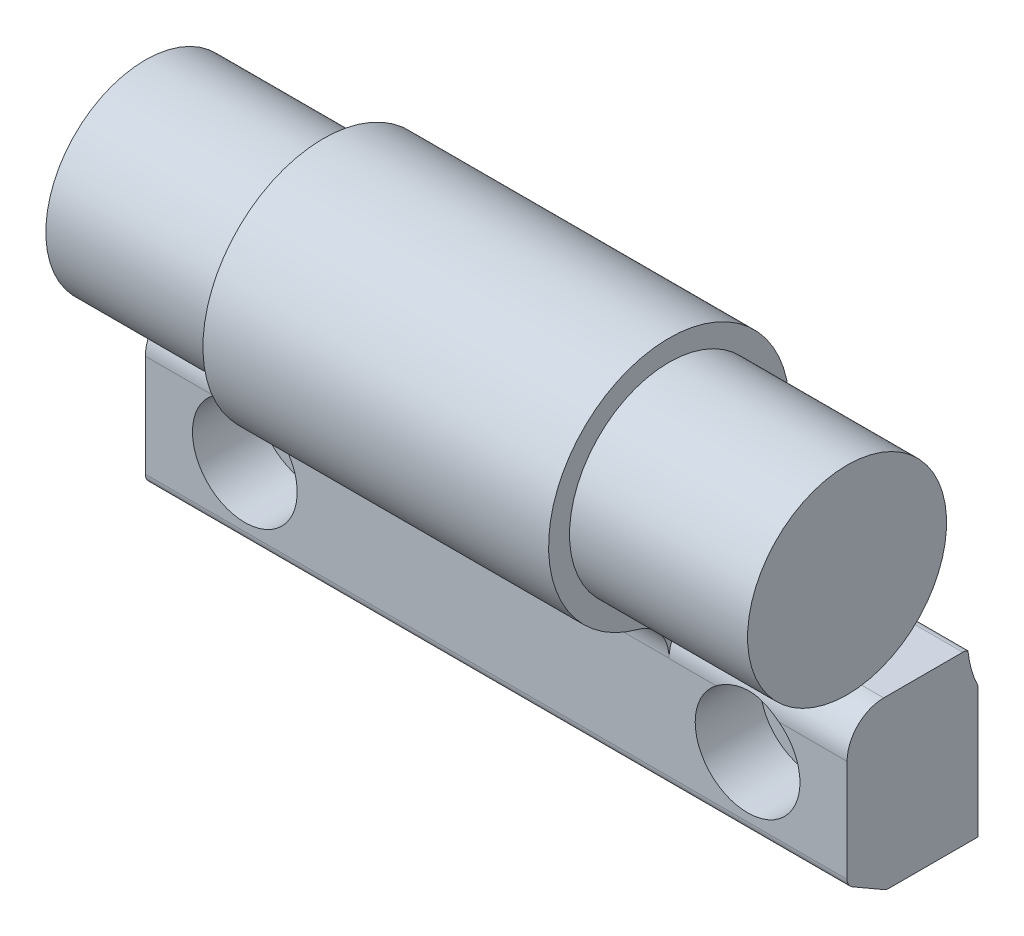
ISO-10303-21;
HEADER;
FILE_DESCRIPTION(('STEP AP214'),'2;1');
FILE_NAME('part.step','',(''),(''),'','','');
FILE_SCHEMA(('AUTOMOTIVE_DESIGN { 1 0 10303 214 1 1 1 1 }'));
ENDSEC;
DATA;
#1=APPLICATION_CONTEXT('core data for automotive mechanical design processes');
#2=APPLICATION_PROTOCOL_DEFINITION('international standard','automotive_design',2000,#1);
#3=PRODUCT_CONTEXT('',#1,'mechanical');
#4=PRODUCT('Part','Part','',(#3));
#5=PRODUCT_RELATED_PRODUCT_CATEGORY('part','',(#4));
#6=PRODUCT_DEFINITION_FORMATION('','',#4);
#7=PRODUCT_DEFINITION_CONTEXT('part definition',#1,'design');
#8=PRODUCT_DEFINITION('design','',#6,#7);
#9=PRODUCT_DEFINITION_SHAPE('','',#8);
#10=(LENGTH_UNIT() NAMED_UNIT(*) SI_UNIT(.MILLI.,.METRE.));
#11=(NAMED_UNIT(*) PLANE_ANGLE_UNIT() SI_UNIT($,.RADIAN.));
#12=(NAMED_UNIT(*) SI_UNIT($,.STERADIAN.) SOLID_ANGLE_UNIT());
#13=UNCERTAINTY_MEASURE_WITH_UNIT(LENGTH_MEASURE(1.E-05),#10,'distance_accuracy_value','');
#14=(GEOMETRIC_REPRESENTATION_CONTEXT(3) GLOBAL_UNCERTAINTY_ASSIGNED_CONTEXT((#13)) GLOBAL_UNIT_ASSIGNED_CONTEXT((#10,
#11,#12)) REPRESENTATION_CONTEXT('',''));
#15=CARTESIAN_POINT('',(0.,0.,0.));
#16=DIRECTION('',(0.,0.,1.));
#17=DIRECTION('',(1.,0.,0.));
#18=AXIS2_PLACEMENT_3D('',#15,#16,#17);
#19=CARTESIAN_POINT('',(-26.,4.,9.));
#20=DIRECTION('',(1.,0.,0.));
#21=DIRECTION('',(0.,1.,0.));
#22=AXIS2_PLACEMENT_3D('',#19,#20,#21);
#23=CYLINDRICAL_SURFACE('',#22,3.5);
#24=DIRECTION('',(1.,0.,0.));
#25=VECTOR('',#24,1.);
#26=CARTESIAN_POINT('',(-26.,4.,12.5));
#27=LINE('',#26,#25);
#28=CARTESIAN_POINT('',(-9.5,4.,12.5));
#29=VERTEX_POINT('',#28);
#30=CARTESIAN_POINT('',(-3.,4.,12.5));
#31=VERTEX_POINT('',#30);
#32=EDGE_CURVE('E160',#29,#31,#27,.T.);
#33=ORIENTED_EDGE('',*,*,#32,.T.);
#34=CARTESIAN_POINT('',(-3.,4.,12.5));
#35=CARTESIAN_POINT('',(-2.88058704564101,4.08958421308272,12.4999653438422));
#36=CARTESIAN_POINT('',(-2.75720915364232,4.17373790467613,12.4965609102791));
#37=CARTESIAN_POINT('',(-2.50364298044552,4.33058069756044,12.4852485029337));
#38=CARTESIAN_POINT('',(-2.37345839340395,4.40327593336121,12.4773429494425));
#39=CARTESIAN_POINT('',(-2.10719122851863,4.53673407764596,12.4592542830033));
#40=CARTESIAN_POINT('',(-1.9711053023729,4.59749010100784,12.4490698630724));
#41=CARTESIAN_POINT('',(-1.69406820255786,4.70662206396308,12.4283781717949));
#42=CARTESIAN_POINT('',(-1.55311680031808,4.75499742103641,12.4178708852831));
#43=CARTESIAN_POINT('',(-1.27819658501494,4.8358206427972,12.3989692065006));
#44=CARTESIAN_POINT('',(-1.14450692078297,4.869197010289,12.3904750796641));
#45=CARTESIAN_POINT('',(-0.874713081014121,4.92481904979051,12.3757281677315));
#46=CARTESIAN_POINT('',(-0.738609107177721,4.9470656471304,12.3694751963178));
#47=CARTESIAN_POINT('',(-0.465141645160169,4.9802191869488,12.3599804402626));
#48=CARTESIAN_POINT('',(-0.327780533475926,4.9911443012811,12.3567338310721));
#49=CARTESIAN_POINT('',(-0.0525849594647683,5.00161918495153,12.3536233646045));
#50=CARTESIAN_POINT('',(0.0852495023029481,5.00116896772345,12.3537595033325));
#51=CARTESIAN_POINT('',(0.359420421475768,4.98893961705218,12.3573855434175));
#52=CARTESIAN_POINT('',(0.495760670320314,4.97723817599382,12.3608524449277));
#53=CARTESIAN_POINT('',(0.766921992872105,4.94272313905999,12.3706963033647));
#54=CARTESIAN_POINT('',(0.901743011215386,4.91990913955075,12.3770733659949));
#55=CARTESIAN_POINT('',(1.16909466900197,4.86332301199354,12.3919799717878));
#56=CARTESIAN_POINT('',(1.30162258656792,4.82953869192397,12.4005119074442));
#57=CARTESIAN_POINT('',(1.56339331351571,4.75125897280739,12.4186580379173));
#58=CARTESIAN_POINT('',(1.69263634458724,4.70676429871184,12.4282721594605));
#59=CARTESIAN_POINT('',(1.92498462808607,4.61597017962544,12.4456242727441));
#60=CARTESIAN_POINT('',(2.02873605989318,4.57132161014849,12.4533985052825));
#61=CARTESIAN_POINT('',(2.2330169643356,4.47508437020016,12.4679477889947));
#62=CARTESIAN_POINT('',(2.33354721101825,4.42349738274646,12.4747230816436));
#63=CARTESIAN_POINT('',(2.53079260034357,4.3136759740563,12.4863526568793));
#64=CARTESIAN_POINT('',(2.62751436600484,4.25545384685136,12.4912104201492));
#65=CARTESIAN_POINT('',(2.8169194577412,4.1325220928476,12.4980294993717));
#66=CARTESIAN_POINT('',(2.90960055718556,4.06780895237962,12.4999892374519));
#67=CARTESIAN_POINT('',(3.,4.,12.5));
#68=B_SPLINE_CURVE_WITH_KNOTS('',3,(#34,#35,#36,#37,#38,#39,#40,#41,#42,#43,#44,#45,#46,#47,#48,
#49,#50,#51,#52,#53,#54,#55,#56,#57,#58,#59,#60,#61,#62,#63,#64,#65,#66,#67),.UNSPECIFIED.,.F.,
.F.,(4,2,2,2,2,2,2,2,2,2,2,2,2,2,2,2,4),(0.,0.447535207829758,0.894829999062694,
1.34238198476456,1.78995502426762,2.20364646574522,2.61730350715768,3.0302955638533,
3.44328713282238,3.85344722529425,4.26362221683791,4.67425463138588,5.08485925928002,
5.42426309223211,5.76358474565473,6.1022876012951,6.44117480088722),.UNSPECIFIED.);
#69=CARTESIAN_POINT('',(3.,4.,12.5));
#70=VERTEX_POINT('',#69);
#71=EDGE_CURVE('E9',#31,#70,#68,.T.);
#72=ORIENTED_EDGE('',*,*,#71,.T.);
#73=CARTESIAN_POINT('',(7.5,4.,12.5));
#74=VERTEX_POINT('',#73);
#75=EDGE_CURVE('E163',#70,#74,#27,.T.);
#76=ORIENTED_EDGE('',*,*,#75,.T.);
#77=CARTESIAN_POINT('',(7.5,4.,9.));
#78=DIRECTION('',(1.,0.,0.));
#79=DIRECTION('',(0.,1.,0.));
#80=AXIS2_PLACEMENT_3D('',#77,#78,#79);
#81=CIRCLE('',#80,3.5);
#82=CARTESIAN_POINT('',(7.5,7.5,9.00000005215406));
#83=VERTEX_POINT('',#82);
#84=EDGE_CURVE('E408',#83,#74,#81,.T.);
#85=ORIENTED_EDGE('',*,*,#84,.F.);
#86=DIRECTION('',(1.,0.,0.));
#87=VECTOR('',#86,1.);
#88=CARTESIAN_POINT('',(-26.,7.5,9.00000005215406));
#89=LINE('',#88,#87);
#90=CARTESIAN_POINT('',(-9.5,7.5,9.00000005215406));
#91=VERTEX_POINT('',#90);
#92=EDGE_CURVE('E175',#91,#83,#89,.T.);
#93=ORIENTED_EDGE('',*,*,#92,.F.);
#94=CARTESIAN_POINT('',(-9.5,4.,9.));
#95=DIRECTION('',(1.,0.,0.));
#96=DIRECTION('',(0.,1.,0.));
#97=AXIS2_PLACEMENT_3D('',#94,#95,#96);
#98=CIRCLE('',#97,3.5);
#99=EDGE_CURVE('E169',#91,#29,#98,.T.);
#100=ORIENTED_EDGE('',*,*,#99,.T.);
#101=EDGE_LOOP('',(#33,#72,#76,#85,#93,#100));
#102=FACE_BOUND('',#101,.T.);
#103=ADVANCED_FACE('F14',(#102),#23,.T.);
#104=CARTESIAN_POINT('',(74.,4.,9.));
#105=DIRECTION('',(-1.,0.,0.));
#106=DIRECTION('',(0.,-1.,0.));
#107=AXIS2_PLACEMENT_3D('',#104,#105,#106);
#108=CYLINDRICAL_SURFACE('',#107,3.5);
#109=CARTESIAN_POINT('',(51.,4.,12.5));
#110=CARTESIAN_POINT('',(50.880587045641,4.08958421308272,12.4999653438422));
#111=CARTESIAN_POINT('',(50.7572091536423,4.17373790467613,12.4965609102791));
#112=CARTESIAN_POINT('',(50.5036429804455,4.33058069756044,12.4852485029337));
#113=CARTESIAN_POINT('',(50.373458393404,4.40327593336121,12.4773429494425));
#114=CARTESIAN_POINT('',(50.1071912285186,4.53673407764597,12.4592542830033));
#115=CARTESIAN_POINT('',(49.9711053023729,4.59749010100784,12.4490698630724));
#116=CARTESIAN_POINT('',(49.6940682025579,4.70662206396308,12.4283781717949));
#117=CARTESIAN_POINT('',(49.5531168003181,4.75499742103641,12.4178708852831));
#118=CARTESIAN_POINT('',(49.2781965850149,4.8358206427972,12.3989692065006));
#119=CARTESIAN_POINT('',(49.144506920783,4.869197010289,12.3904750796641));
#120=CARTESIAN_POINT('',(48.8747130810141,4.92481904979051,12.3757281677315));
#121=CARTESIAN_POINT('',(48.7386091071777,4.9470656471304,12.3694751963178));
#122=CARTESIAN_POINT('',(48.4651416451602,4.9802191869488,12.3599804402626));
#123=CARTESIAN_POINT('',(48.327780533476,4.9911443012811,12.3567338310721));
#124=CARTESIAN_POINT('',(48.0525849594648,5.00161918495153,12.3536233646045));
#125=CARTESIAN_POINT('',(47.9147504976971,5.00116896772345,12.3537595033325));
#126=CARTESIAN_POINT('',(47.6405795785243,4.98893961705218,12.3573855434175));
#127=CARTESIAN_POINT('',(47.5042393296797,4.97723817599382,12.3608524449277));
#128=CARTESIAN_POINT('',(47.2330780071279,4.94272313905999,12.3706963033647));
#129=CARTESIAN_POINT('',(47.0982569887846,4.91990913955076,12.3770733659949));
#130=CARTESIAN_POINT('',(46.830905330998,4.86332301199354,12.3919799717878));
#131=CARTESIAN_POINT('',(46.6983774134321,4.82953869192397,12.4005119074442));
#132=CARTESIAN_POINT('',(46.4366066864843,4.75125897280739,12.4186580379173));
#133=CARTESIAN_POINT('',(46.3073636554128,4.70676429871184,12.4282721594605));
#134=CARTESIAN_POINT('',(46.0750153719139,4.61597017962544,12.4456242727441));
#135=CARTESIAN_POINT('',(45.9712639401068,4.57132161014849,12.4533985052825));
#136=CARTESIAN_POINT('',(45.7669830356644,4.47508437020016,12.4679477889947));
#137=CARTESIAN_POINT('',(45.6664527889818,4.42349738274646,12.4747230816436));
#138=CARTESIAN_POINT('',(45.4692073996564,4.3136759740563,12.4863526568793));
#139=CARTESIAN_POINT('',(45.3724856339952,4.25545384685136,12.4912104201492));
#140=CARTESIAN_POINT('',(45.1830805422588,4.1325220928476,12.4980294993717));
#141=CARTESIAN_POINT('',(45.0903994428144,4.06780895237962,12.4999892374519));
#142=CARTESIAN_POINT('',(45.,4.,12.5));
#143=B_SPLINE_CURVE_WITH_KNOTS('',3,(#109,#110,#111,#112,#113,#114,#115,#116,#117,#118,#119,
#120,#121,#122,#123,#124,#125,#126,#127,#128,#129,#130,#131,#132,#133,#134,#135,#136,#137,#138,
#139,#140,#141,#142),.UNSPECIFIED.,.F.,.F.,(4,2,2,2,2,2,2,2,2,2,2,2,2,2,2,2,4),(0.,
0.447535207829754,0.894829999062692,1.34238198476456,1.78995502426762,2.20364646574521,
2.61730350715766,3.03029556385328,3.44328713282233,3.85344722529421,4.26362221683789,
4.67425463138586,5.08485925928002,5.42426309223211,5.76358474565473,6.10228760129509,
6.44117480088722),.UNSPECIFIED.);
#144=CARTESIAN_POINT('',(51.,4.,12.5));
#145=VERTEX_POINT('',#144);
#146=CARTESIAN_POINT('',(45.,4.,12.5));
#147=VERTEX_POINT('',#146);
#148=EDGE_CURVE('E28',#145,#147,#143,.T.);
#149=ORIENTED_EDGE('',*,*,#148,.F.);
#150=DIRECTION('',(-1.,0.,0.));
#151=VECTOR('',#150,1.);
#152=CARTESIAN_POINT('',(74.,4.,12.5));
#153=LINE('',#152,#151);
#154=CARTESIAN_POINT('',(57.5,4.,12.5));
#155=VERTEX_POINT('',#154);
#156=EDGE_CURVE('E428',#155,#145,#153,.T.);
#157=ORIENTED_EDGE('',*,*,#156,.F.);
#158=CARTESIAN_POINT('',(57.5,4.,9.));
#159=DIRECTION('',(1.,0.,0.));
#160=DIRECTION('',(0.,1.,0.));
#161=AXIS2_PLACEMENT_3D('',#158,#159,#160);
#162=CIRCLE('',#161,3.5);
#163=CARTESIAN_POINT('',(57.5,7.5,9.00000005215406));
#164=VERTEX_POINT('',#163);
#165=EDGE_CURVE('E260',#155,#164,#162,.F.);
#166=ORIENTED_EDGE('',*,*,#165,.T.);
#167=DIRECTION('',(-1.,0.,0.));
#168=VECTOR('',#167,1.);
#169=CARTESIAN_POINT('',(74.,7.5,9.00000005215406));
#170=LINE('',#169,#168);
#171=CARTESIAN_POINT('',(40.5,7.5,9.00000005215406));
#172=VERTEX_POINT('',#171);
#173=EDGE_CURVE('E431',#164,#172,#170,.T.);
#174=ORIENTED_EDGE('',*,*,#173,.T.);
#175=CARTESIAN_POINT('',(40.5,4.,9.));
#176=DIRECTION('',(1.,0.,0.));
#177=DIRECTION('',(0.,1.,0.));
#178=AXIS2_PLACEMENT_3D('',#175,#176,#177);
#179=CIRCLE('',#178,3.5);
#180=CARTESIAN_POINT('',(40.5,4.,12.5));
#181=VERTEX_POINT('',#180);
#182=EDGE_CURVE('E268',#172,#181,#179,.T.);
#183=ORIENTED_EDGE('',*,*,#182,.T.);
#184=EDGE_CURVE('E430',#147,#181,#153,.T.);
#185=ORIENTED_EDGE('',*,*,#184,.F.);
#186=EDGE_LOOP('',(#149,#157,#166,#174,#183,#185));
#187=FACE_BOUND('',#186,.T.);
#188=ADVANCED_FACE('F276',(#187),#108,.T.);
#189=CARTESIAN_POINT('',(57.5,4.02502086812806,12.5));
#190=DIRECTION('',(0.,0.,-1.));
#191=DIRECTION('',(-1.,0.,0.));
#192=AXIS2_PLACEMENT_3D('',#189,#190,#191);
#193=PLANE('',#192);
#194=ORIENTED_EDGE('',*,*,#75,.F.);
#195=CARTESIAN_POINT('',(0.,0.,12.5));
#196=DIRECTION('',(0.,0.,-1.));
#197=DIRECTION('',(-1.,0.,0.));
#198=AXIS2_PLACEMENT_3D('',#195,#196,#197);
#199=CIRCLE('',#198,5.);
#200=EDGE_CURVE('E34',#70,#31,#199,.T.);
#201=ORIENTED_EDGE('',*,*,#200,.T.);
#202=ORIENTED_EDGE('',*,*,#32,.F.);
#203=DIRECTION('',(0.,-1.,0.));
#204=VECTOR('',#203,1.);
#205=CARTESIAN_POINT('',(-9.5,4.02502086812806,12.5));
#206=LINE('',#205,#204);
#207=CARTESIAN_POINT('',(-9.5,-5.7575862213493,12.5));
#208=VERTEX_POINT('',#207);
#209=EDGE_CURVE('E218',#29,#208,#206,.T.);
#210=ORIENTED_EDGE('',*,*,#209,.T.);
#211=DIRECTION('',(-1.,0.,0.));
#212=VECTOR('',#211,1.);
#213=CARTESIAN_POINT('',(57.5,-5.7575862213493,12.5));
#214=LINE('',#213,#212);
#215=CARTESIAN_POINT('',(57.5,-5.7575862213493,12.5));
#216=VERTEX_POINT('',#215);
#217=EDGE_CURVE('E228',#216,#208,#214,.T.);
#218=ORIENTED_EDGE('',*,*,#217,.F.);
#219=DIRECTION('',(0.,-1.,0.));
#220=VECTOR('',#219,1.);
#221=CARTESIAN_POINT('',(57.5,4.02502086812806,12.5));
#222=LINE('',#221,#220);
#223=EDGE_CURVE('E201',#155,#216,#222,.T.);
#224=ORIENTED_EDGE('',*,*,#223,.F.);
#225=ORIENTED_EDGE('',*,*,#156,.T.);
#226=CARTESIAN_POINT('',(48.,0.,12.5));
#227=DIRECTION('',(0.,0.,-1.));
#228=DIRECTION('',(-1.,0.,0.));
#229=AXIS2_PLACEMENT_3D('',#226,#227,#228);
#230=CIRCLE('',#229,5.);
#231=EDGE_CURVE('E40',#145,#147,#230,.T.);
#232=ORIENTED_EDGE('',*,*,#231,.T.);
#233=ORIENTED_EDGE('',*,*,#184,.T.);
#234=DIRECTION('',(0.,-1.,0.));
#235=VECTOR('',#234,1.);
#236=CARTESIAN_POINT('',(40.5,4.02502086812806,12.5));
#237=LINE('',#236,#235);
#238=CARTESIAN_POINT('',(40.5,4.02502086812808,12.5));
#239=VERTEX_POINT('',#238);
#240=EDGE_CURVE('E420',#239,#181,#237,.T.);
#241=ORIENTED_EDGE('',*,*,#240,.F.);
#242=DIRECTION('',(-1.,0.,0.));
#243=VECTOR('',#242,1.);
#244=CARTESIAN_POINT('',(57.5,4.02502086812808,12.5));
#245=LINE('',#244,#243);
#246=CARTESIAN_POINT('',(7.5,4.02502086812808,12.5));
#247=VERTEX_POINT('',#246);
#248=EDGE_CURVE('E231',#239,#247,#245,.T.);
#249=ORIENTED_EDGE('',*,*,#248,.T.);
#250=DIRECTION('',(0.,-1.,0.));
#251=VECTOR('',#250,1.);
#252=CARTESIAN_POINT('',(7.5,4.02502086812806,12.5));
#253=LINE('',#252,#251);
#254=EDGE_CURVE('E253',#247,#74,#253,.T.);
#255=ORIENTED_EDGE('',*,*,#254,.T.);
#256=EDGE_LOOP('',(#194,#201,#202,#210,#218,#224,#225,#232,#233,#241,#249,#255));
#257=FACE_BOUND('',#256,.T.);
#258=ADVANCED_FACE('F159',(#257),#193,.F.);
#259=CARTESIAN_POINT('',(57.5,8.,1.));
#260=DIRECTION('',(0.,0.,1.));
#261=DIRECTION('',(1.,0.,0.));
#262=AXIS2_PLACEMENT_3D('',#259,#260,#261);
#263=PLANE('',#262);
#264=DIRECTION('',(0.,1.,0.));
#265=VECTOR('',#264,1.);
#266=CARTESIAN_POINT('',(40.5,8.,1.));
#267=LINE('',#266,#265);
#268=CARTESIAN_POINT('',(40.5,8.,1.));
#269=VERTEX_POINT('',#268);
#270=CARTESIAN_POINT('',(40.5,19.,1.));
#271=VERTEX_POINT('',#270);
#272=EDGE_CURVE('E423',#269,#271,#267,.T.);
#273=ORIENTED_EDGE('',*,*,#272,.F.);
#274=DIRECTION('',(-1.,0.,0.));
#275=VECTOR('',#274,1.);
#276=CARTESIAN_POINT('',(57.5,8.,1.));
#277=LINE('',#276,#275);
#278=CARTESIAN_POINT('',(7.5,8.,1.));
#279=VERTEX_POINT('',#278);
#280=EDGE_CURVE('E237',#269,#279,#277,.T.);
#281=ORIENTED_EDGE('',*,*,#280,.T.);
#282=DIRECTION('',(0.,1.,0.));
#283=VECTOR('',#282,1.);
#284=CARTESIAN_POINT('',(7.5,8.,1.));
#285=LINE('',#284,#283);
#286=CARTESIAN_POINT('',(7.5,19.,1.));
#287=VERTEX_POINT('',#286);
#288=EDGE_CURVE('E184',#279,#287,#285,.T.);
#289=ORIENTED_EDGE('',*,*,#288,.T.);
#290=DIRECTION('',(-1.,0.,0.));
#291=VECTOR('',#290,1.);
#292=CARTESIAN_POINT('',(57.5,19.,1.));
#293=LINE('',#292,#291);
#294=EDGE_CURVE('E235',#271,#287,#293,.T.);
#295=ORIENTED_EDGE('',*,*,#294,.F.);
#296=EDGE_LOOP('',(#273,#281,#289,#295));
#297=FACE_BOUND('',#296,.T.);
#298=ADVANCED_FACE('F351',(#297),#263,.F.);
#299=CARTESIAN_POINT('',(57.5,19.,12.5));
#300=DIRECTION('',(-1.,0.,0.));
#301=DIRECTION('',(0.,-1.,0.));
#302=AXIS2_PLACEMENT_3D('',#299,#300,#301);
#303=CYLINDRICAL_SURFACE('',#302,11.5);
#304=CARTESIAN_POINT('',(40.5,19.,12.5));
#305=DIRECTION('',(1.,0.,0.));
#306=DIRECTION('',(0.,1.,0.));
#307=AXIS2_PLACEMENT_3D('',#304,#305,#306);
#308=CIRCLE('',#307,11.5);
#309=CARTESIAN_POINT('',(40.5,7.88953161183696,15.4677419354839));
#310=VERTEX_POINT('',#309);
#311=EDGE_CURVE('E425',#271,#310,#308,.T.);
#312=ORIENTED_EDGE('',*,*,#311,.F.);
#313=ORIENTED_EDGE('',*,*,#294,.T.);
#314=CARTESIAN_POINT('',(7.5,19.,12.5));
#315=DIRECTION('',(1.,0.,0.));
#316=DIRECTION('',(0.,1.,0.));
#317=AXIS2_PLACEMENT_3D('',#314,#315,#316);
#318=CIRCLE('',#317,11.5);
#319=CARTESIAN_POINT('',(7.5,7.88953161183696,15.4677419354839));
#320=VERTEX_POINT('',#319);
#321=EDGE_CURVE('E181',#287,#320,#318,.T.);
#322=ORIENTED_EDGE('',*,*,#321,.T.);
#323=DIRECTION('',(-1.,0.,0.));
#324=VECTOR('',#323,1.);
#325=CARTESIAN_POINT('',(57.5,7.88953161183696,15.4677419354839));
#326=LINE('',#325,#324);
#327=EDGE_CURVE('E233',#310,#320,#326,.T.);
#328=ORIENTED_EDGE('',*,*,#327,.F.);
#329=EDGE_LOOP('',(#312,#313,#322,#328));
#330=FACE_BOUND('',#329,.T.);
#331=ADVANCED_FACE('F354',(#330),#303,.T.);
#332=CARTESIAN_POINT('',(57.5,4.02502086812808,16.5));
#333=DIRECTION('',(-1.,0.,0.));
#334=DIRECTION('',(0.,-1.,0.));
#335=AXIS2_PLACEMENT_3D('',#332,#333,#334);
#336=CYLINDRICAL_SURFACE('',#335,4.);
#337=ORIENTED_EDGE('',*,*,#248,.F.);
#338=CARTESIAN_POINT('',(40.5,4.02502086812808,16.5));
#339=DIRECTION('',(1.,0.,0.));
#340=DIRECTION('',(0.,1.,0.));
#341=AXIS2_PLACEMENT_3D('',#338,#339,#340);
#342=CIRCLE('',#341,4.);
#343=EDGE_CURVE('E262',#239,#310,#342,.T.);
#344=ORIENTED_EDGE('',*,*,#343,.T.);
#345=ORIENTED_EDGE('',*,*,#327,.T.);
#346=CARTESIAN_POINT('',(7.5,4.02502086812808,16.5));
#347=DIRECTION('',(1.,0.,0.));
#348=DIRECTION('',(0.,1.,0.));
#349=AXIS2_PLACEMENT_3D('',#346,#347,#348);
#350=CIRCLE('',#349,4.);
#351=EDGE_CURVE('E173',#247,#320,#350,.T.);
#352=ORIENTED_EDGE('',*,*,#351,.F.);
#353=EDGE_LOOP('',(#337,#344,#345,#352));
#354=FACE_BOUND('',#353,.T.);
#355=ADVANCED_FACE('F334',(#354),#336,.F.);
#356=CARTESIAN_POINT('',(57.5,-7.5,8.48205080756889));
#357=DIRECTION('',(1.,0.,0.));
#358=DIRECTION('',(0.,1.,0.));
#359=AXIS2_PLACEMENT_3D('',#356,#357,#358);
#360=PLANE('',#359);
#361=ORIENTED_EDGE('',*,*,#165,.F.);
#362=ORIENTED_EDGE('',*,*,#223,.T.);
#363=CARTESIAN_POINT('',(57.5,-5.7575862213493,11.5));
#364=DIRECTION('',(1.,0.,0.));
#365=DIRECTION('',(0.,1.,0.));
#366=AXIS2_PLACEMENT_3D('',#363,#364,#365);
#367=CIRCLE('',#366,1.);
#368=CARTESIAN_POINT('',(57.5,-6.6236116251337,12.));
#369=VERTEX_POINT('',#368);
#370=EDGE_CURVE('E203',#216,#369,#367,.T.);
#371=ORIENTED_EDGE('',*,*,#370,.T.);
#372=DIRECTION('',(0.,-0.5,-0.866025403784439));
#373=VECTOR('',#372,1.);
#374=CARTESIAN_POINT('',(57.5,-6.6236116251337,12.));
#375=LINE('',#374,#373);
#376=CARTESIAN_POINT('',(57.5,-8.36602540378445,8.98205080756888));
#377=VERTEX_POINT('',#376);
#378=EDGE_CURVE('E205',#369,#377,#375,.T.);
#379=ORIENTED_EDGE('',*,*,#378,.T.);
#380=CARTESIAN_POINT('',(57.5,-7.5,8.48205080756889));
#381=DIRECTION('',(1.,0.,0.));
#382=DIRECTION('',(0.,1.,0.));
#383=AXIS2_PLACEMENT_3D('',#380,#381,#382);
#384=CIRCLE('',#383,0.999999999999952);
#385=CARTESIAN_POINT('',(57.5,-8.5,8.48205080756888));
#386=VERTEX_POINT('',#385);
#387=EDGE_CURVE('E190',#377,#386,#384,.T.);
#388=ORIENTED_EDGE('',*,*,#387,.T.);
#389=DIRECTION('',(0.,0.,-1.));
#390=VECTOR('',#389,1.);
#391=CARTESIAN_POINT('',(57.5,-8.5,8.48205080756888));
#392=LINE('',#391,#390);
#393=CARTESIAN_POINT('',(57.5,-8.5,0.));
#394=VERTEX_POINT('',#393);
#395=EDGE_CURVE('E193',#386,#394,#392,.T.);
#396=ORIENTED_EDGE('',*,*,#395,.T.);
#397=DIRECTION('',(0.,1.,0.));
#398=VECTOR('',#397,1.);
#399=CARTESIAN_POINT('',(57.5,-8.5,0.));
#400=LINE('',#399,#398);
#401=CARTESIAN_POINT('',(57.5,4.,0.));
#402=VERTEX_POINT('',#401);
#403=EDGE_CURVE('E196',#394,#402,#400,.T.);
#404=ORIENTED_EDGE('',*,*,#403,.T.);
#405=CARTESIAN_POINT('',(57.5,8.37325787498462,-8.99303149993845));
#406=DIRECTION('',(1.,0.,0.));
#407=DIRECTION('',(0.,1.,0.));
#408=AXIS2_PLACEMENT_3D('',#405,#406,#407);
#409=CIRCLE('',#408,10.);
#410=CARTESIAN_POINT('',(57.5,7.36760936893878,0.956273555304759));
#411=VERTEX_POINT('',#410);
#412=EDGE_CURVE('E199',#411,#402,#409,.T.);
#413=ORIENTED_EDGE('',*,*,#412,.F.);
#414=CARTESIAN_POINT('',(57.5,6.5,1.4535199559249));
#415=DIRECTION('',(1.,0.,0.));
#416=DIRECTION('',(0.,1.,0.));
#417=AXIS2_PLACEMENT_3D('',#414,#415,#416);
#418=CIRCLE('',#417,1.);
#419=CARTESIAN_POINT('',(57.5,7.5,1.4535199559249));
#420=VERTEX_POINT('',#419);
#421=EDGE_CURVE('E255',#420,#411,#418,.F.);
#422=ORIENTED_EDGE('',*,*,#421,.F.);
#423=DIRECTION('',(0.,0.,1.));
#424=VECTOR('',#423,1.);
#425=CARTESIAN_POINT('',(57.5,7.5,8.48205080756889));
#426=LINE('',#425,#424);
#427=EDGE_CURVE('E257',#420,#164,#426,.T.);
#428=ORIENTED_EDGE('',*,*,#427,.T.);
#429=EDGE_LOOP('',(#361,#362,#371,#379,#388,#396,#404,#413,#422,#428));
#430=FACE_BOUND('',#429,.T.);
#431=ADVANCED_FACE('F330',(#430),#360,.T.);
#432=CARTESIAN_POINT('',(57.5,8.37325787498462,-8.99303149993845));
#433=DIRECTION('',(-1.,0.,0.));
#434=DIRECTION('',(0.,-1.,0.));
#435=AXIS2_PLACEMENT_3D('',#432,#433,#434);
#436=CYLINDRICAL_SURFACE('',#435,10.);
#437=DIRECTION('',(-1.,0.,0.));
#438=VECTOR('',#437,1.);
#439=CARTESIAN_POINT('',(57.25,7.36760936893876,0.956273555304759));
#440=LINE('',#439,#438);
#441=CARTESIAN_POINT('',(40.5,7.36760936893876,0.956273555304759));
#442=VERTEX_POINT('',#441);
#443=EDGE_CURVE('E388',#411,#442,#440,.T.);
#444=ORIENTED_EDGE('',*,*,#443,.F.);
#445=ORIENTED_EDGE('',*,*,#412,.T.);
#446=DIRECTION('',(-1.,0.,0.));
#447=VECTOR('',#446,1.);
#448=CARTESIAN_POINT('',(57.5,4.,0.));
#449=LINE('',#448,#447);
#450=CARTESIAN_POINT('',(-9.5,4.,0.));
#451=VERTEX_POINT('',#450);
#452=EDGE_CURVE('E239',#402,#451,#449,.T.);
#453=ORIENTED_EDGE('',*,*,#452,.T.);
#454=CARTESIAN_POINT('',(-9.5,8.37325787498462,-8.99303149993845));
#455=DIRECTION('',(1.,0.,0.));
#456=DIRECTION('',(0.,1.,0.));
#457=AXIS2_PLACEMENT_3D('',#454,#455,#456);
#458=CIRCLE('',#457,10.);
#459=CARTESIAN_POINT('',(-9.5,7.36760936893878,0.956273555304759));
#460=VERTEX_POINT('',#459);
#461=EDGE_CURVE('E215',#460,#451,#458,.T.);
#462=ORIENTED_EDGE('',*,*,#461,.F.);
#463=DIRECTION('',(1.,0.,0.));
#464=VECTOR('',#463,1.);
#465=CARTESIAN_POINT('',(-9.25,7.36760936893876,0.956273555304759));
#466=LINE('',#465,#464);
#467=CARTESIAN_POINT('',(7.5,7.36760936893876,0.956273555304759));
#468=VERTEX_POINT('',#467);
#469=EDGE_CURVE('E170',#460,#468,#466,.T.);
#470=ORIENTED_EDGE('',*,*,#469,.T.);
#471=CARTESIAN_POINT('',(7.5,8.37325787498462,-8.99303149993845));
#472=DIRECTION('',(1.,0.,0.));
#473=DIRECTION('',(0.,1.,0.));
#474=AXIS2_PLACEMENT_3D('',#471,#472,#473);
#475=CIRCLE('',#474,10.);
#476=EDGE_CURVE('E187',#279,#468,#475,.T.);
#477=ORIENTED_EDGE('',*,*,#476,.F.);
#478=ORIENTED_EDGE('',*,*,#280,.F.);
#479=CARTESIAN_POINT('',(40.5,8.37325787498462,-8.99303149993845));
#480=DIRECTION('',(1.,0.,0.));
#481=DIRECTION('',(0.,1.,0.));
#482=AXIS2_PLACEMENT_3D('',#479,#480,#481);
#483=CIRCLE('',#482,10.);
#484=EDGE_CURVE('E418',#269,#442,#483,.T.);
#485=ORIENTED_EDGE('',*,*,#484,.T.);
#486=EDGE_LOOP('',(#444,#445,#453,#462,#470,#477,#478,#485));
#487=FACE_BOUND('',#486,.T.);
#488=ADVANCED_FACE('F333',(#487),#436,.F.);
#489=CARTESIAN_POINT('',(-9.5,-7.5,8.48205080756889));
#490=DIRECTION('',(1.,0.,0.));
#491=DIRECTION('',(0.,1.,0.));
#492=AXIS2_PLACEMENT_3D('',#489,#490,#491);
#493=PLANE('',#492);
#494=ORIENTED_EDGE('',*,*,#99,.F.);
#495=DIRECTION('',(0.,0.,-1.));
#496=VECTOR('',#495,1.);
#497=CARTESIAN_POINT('',(-9.5,7.5,8.48205080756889));
#498=LINE('',#497,#496);
#499=CARTESIAN_POINT('',(-9.5,7.5,1.45351995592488));
#500=VERTEX_POINT('',#499);
#501=EDGE_CURVE('E249',#91,#500,#498,.T.);
#502=ORIENTED_EDGE('',*,*,#501,.T.);
#503=CARTESIAN_POINT('',(-9.5,6.5,1.4535199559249));
#504=DIRECTION('',(1.,0.,0.));
#505=DIRECTION('',(0.,1.,0.));
#506=AXIS2_PLACEMENT_3D('',#503,#504,#505);
#507=CIRCLE('',#506,1.);
#508=EDGE_CURVE('E247',#460,#500,#507,.T.);
#509=ORIENTED_EDGE('',*,*,#508,.F.);
#510=ORIENTED_EDGE('',*,*,#461,.T.);
#511=DIRECTION('',(0.,1.,0.));
#512=VECTOR('',#511,1.);
#513=CARTESIAN_POINT('',(-9.5,-8.5,0.));
#514=LINE('',#513,#512);
#515=CARTESIAN_POINT('',(-9.5,-8.5,0.));
#516=VERTEX_POINT('',#515);
#517=EDGE_CURVE('E212',#516,#451,#514,.T.);
#518=ORIENTED_EDGE('',*,*,#517,.F.);
#519=DIRECTION('',(0.,0.,-1.));
#520=VECTOR('',#519,1.);
#521=CARTESIAN_POINT('',(-9.5,-8.5,8.48205080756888));
#522=LINE('',#521,#520);
#523=CARTESIAN_POINT('',(-9.5,-8.5,8.48205080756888));
#524=VERTEX_POINT('',#523);
#525=EDGE_CURVE('E210',#524,#516,#522,.T.);
#526=ORIENTED_EDGE('',*,*,#525,.F.);
#527=CARTESIAN_POINT('',(-9.5,-7.5,8.48205080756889));
#528=DIRECTION('',(1.,0.,0.));
#529=DIRECTION('',(0.,1.,0.));
#530=AXIS2_PLACEMENT_3D('',#527,#528,#529);
#531=CIRCLE('',#530,0.999999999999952);
#532=CARTESIAN_POINT('',(-9.5,-8.36602540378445,8.98205080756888));
#533=VERTEX_POINT('',#532);
#534=EDGE_CURVE('E189',#533,#524,#531,.T.);
#535=ORIENTED_EDGE('',*,*,#534,.F.);
#536=DIRECTION('',(0.,-0.5,-0.866025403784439));
#537=VECTOR('',#536,1.);
#538=CARTESIAN_POINT('',(-9.5,-6.6236116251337,12.));
#539=LINE('',#538,#537);
#540=CARTESIAN_POINT('',(-9.5,-6.6236116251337,12.));
#541=VERTEX_POINT('',#540);
#542=EDGE_CURVE('E194',#541,#533,#539,.T.);
#543=ORIENTED_EDGE('',*,*,#542,.F.);
#544=CARTESIAN_POINT('',(-9.5,-5.7575862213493,11.5));
#545=DIRECTION('',(1.,0.,0.));
#546=DIRECTION('',(0.,1.,0.));
#547=AXIS2_PLACEMENT_3D('',#544,#545,#546);
#548=CIRCLE('',#547,1.);
#549=EDGE_CURVE('E220',#208,#541,#548,.T.);
#550=ORIENTED_EDGE('',*,*,#549,.F.);
#551=ORIENTED_EDGE('',*,*,#209,.F.);
#552=EDGE_LOOP('',(#494,#502,#509,#510,#518,#526,#535,#543,#550,#551));
#553=FACE_BOUND('',#552,.T.);
#554=ADVANCED_FACE('F336',(#553),#493,.F.);
#555=CARTESIAN_POINT('',(57.5,-7.5,8.48205080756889));
#556=DIRECTION('',(-1.,0.,0.));
#557=DIRECTION('',(0.,-1.,0.));
#558=AXIS2_PLACEMENT_3D('',#555,#556,#557);
#559=CYLINDRICAL_SURFACE('',#558,0.999999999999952);
#560=ORIENTED_EDGE('',*,*,#534,.T.);
#561=DIRECTION('',(-1.,0.,0.));
#562=VECTOR('',#561,1.);
#563=CARTESIAN_POINT('',(57.5,-8.5,8.48205080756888));
#564=LINE('',#563,#562);
#565=EDGE_CURVE('E244',#386,#524,#564,.T.);
#566=ORIENTED_EDGE('',*,*,#565,.F.);
#567=ORIENTED_EDGE('',*,*,#387,.F.);
#568=DIRECTION('',(-1.,0.,0.));
#569=VECTOR('',#568,1.);
#570=CARTESIAN_POINT('',(57.5,-8.36602540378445,8.98205080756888));
#571=LINE('',#570,#569);
#572=EDGE_CURVE('E207',#377,#533,#571,.T.);
#573=ORIENTED_EDGE('',*,*,#572,.T.);
#574=EDGE_LOOP('',(#560,#566,#567,#573));
#575=FACE_BOUND('',#574,.T.);
#576=ADVANCED_FACE('F16',(#575),#559,.T.);
#577=CARTESIAN_POINT('',(57.5,-8.5,8.48205080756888));
#578=DIRECTION('',(0.,1.,0.));
#579=DIRECTION('',(-1.,0.,0.));
#580=AXIS2_PLACEMENT_3D('',#577,#578,#579);
#581=PLANE('',#580);
#582=ORIENTED_EDGE('',*,*,#525,.T.);
#583=DIRECTION('',(-1.,0.,0.));
#584=VECTOR('',#583,1.);
#585=CARTESIAN_POINT('',(57.5,-8.5,0.));
#586=LINE('',#585,#584);
#587=EDGE_CURVE('E241',#394,#516,#586,.T.);
#588=ORIENTED_EDGE('',*,*,#587,.F.);
#589=ORIENTED_EDGE('',*,*,#395,.F.);
#590=ORIENTED_EDGE('',*,*,#565,.T.);
#591=EDGE_LOOP('',(#582,#588,#589,#590));
#592=FACE_BOUND('',#591,.T.);
#593=ADVANCED_FACE('F366',(#592),#581,.F.);
#594=CARTESIAN_POINT('',(57.5,-8.5,0.));
#595=DIRECTION('',(0.,0.,1.));
#596=DIRECTION('',(1.,0.,0.));
#597=AXIS2_PLACEMENT_3D('',#594,#595,#596);
#598=PLANE('',#597);
#599=CARTESIAN_POINT('',(0.,0.,0.));
#600=DIRECTION('',(0.,0.,-1.));
#601=DIRECTION('',(-1.,0.,0.));
#602=AXIS2_PLACEMENT_3D('',#599,#600,#601);
#603=CIRCLE('',#602,3.25);
#604=CARTESIAN_POINT('',(-3.25,0.,0.));
#605=VERTEX_POINT('',#604);
#606=EDGE_CURVE('E464',#605,#605,#603,.T.);
#607=ORIENTED_EDGE('',*,*,#606,.F.);
#608=EDGE_LOOP('',(#607));
#609=FACE_BOUND('',#608,.T.);
#610=CARTESIAN_POINT('',(48.,0.,0.));
#611=DIRECTION('',(0.,0.,-1.));
#612=DIRECTION('',(-1.,0.,0.));
#613=AXIS2_PLACEMENT_3D('',#610,#611,#612);
#614=CIRCLE('',#613,3.25);
#615=CARTESIAN_POINT('',(44.75,0.,0.));
#616=VERTEX_POINT('',#615);
#617=EDGE_CURVE('E164',#616,#616,#614,.T.);
#618=ORIENTED_EDGE('',*,*,#617,.F.);
#619=EDGE_LOOP('',(#618));
#620=FACE_BOUND('',#619,.T.);
#621=ORIENTED_EDGE('',*,*,#517,.T.);
#622=ORIENTED_EDGE('',*,*,#452,.F.);
#623=ORIENTED_EDGE('',*,*,#403,.F.);
#624=ORIENTED_EDGE('',*,*,#587,.T.);
#625=EDGE_LOOP('',(#621,#622,#623,#624));
#626=FACE_BOUND('',#625,.T.);
#627=ADVANCED_FACE('F347',(#609,#620,#626),#598,.F.);
#628=CARTESIAN_POINT('',(57.5,-5.7575862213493,11.5));
#629=DIRECTION('',(-1.,0.,0.));
#630=DIRECTION('',(0.,-1.,0.));
#631=AXIS2_PLACEMENT_3D('',#628,#629,#630);
#632=CYLINDRICAL_SURFACE('',#631,1.);
#633=ORIENTED_EDGE('',*,*,#549,.T.);
#634=DIRECTION('',(-1.,0.,0.));
#635=VECTOR('',#634,1.);
#636=CARTESIAN_POINT('',(57.5,-6.6236116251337,12.));
#637=LINE('',#636,#635);
#638=EDGE_CURVE('E225',#369,#541,#637,.T.);
#639=ORIENTED_EDGE('',*,*,#638,.F.);
#640=ORIENTED_EDGE('',*,*,#370,.F.);
#641=ORIENTED_EDGE('',*,*,#217,.T.);
#642=EDGE_LOOP('',(#633,#639,#640,#641));
#643=FACE_BOUND('',#642,.T.);
#644=ADVANCED_FACE('F343',(#643),#632,.T.);
#645=CARTESIAN_POINT('',(57.5,-6.6236116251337,12.));
#646=DIRECTION('',(0.,0.866025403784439,-0.5));
#647=DIRECTION('',(0.,0.5,0.866025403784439));
#648=AXIS2_PLACEMENT_3D('',#645,#646,#647);
#649=PLANE('',#648);
#650=ORIENTED_EDGE('',*,*,#542,.T.);
#651=ORIENTED_EDGE('',*,*,#572,.F.);
#652=ORIENTED_EDGE('',*,*,#378,.F.);
#653=ORIENTED_EDGE('',*,*,#638,.T.);
#654=EDGE_LOOP('',(#650,#651,#652,#653));
#655=FACE_BOUND('',#654,.T.);
#656=ADVANCED_FACE('F340',(#655),#649,.F.);
#657=CARTESIAN_POINT('',(-26.,7.5,9.));
#658=DIRECTION('',(0.,-1.,0.));
#659=DIRECTION('',(1.,0.,0.));
#660=AXIS2_PLACEMENT_3D('',#657,#658,#659);
#661=PLANE('',#660);
#662=ORIENTED_EDGE('',*,*,#92,.T.);
#663=DIRECTION('',(0.,0.,-1.));
#664=VECTOR('',#663,1.);
#665=CARTESIAN_POINT('',(7.5,7.5,9.));
#666=LINE('',#665,#664);
#667=CARTESIAN_POINT('',(7.5,7.5,1.45351995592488));
#668=VERTEX_POINT('',#667);
#669=EDGE_CURVE('E413',#83,#668,#666,.T.);
#670=ORIENTED_EDGE('',*,*,#669,.T.);
#671=DIRECTION('',(1.,0.,0.));
#672=VECTOR('',#671,1.);
#673=CARTESIAN_POINT('',(-26.,7.5,1.45351995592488));
#674=LINE('',#673,#672);
#675=EDGE_CURVE('E405',#500,#668,#674,.T.);
#676=ORIENTED_EDGE('',*,*,#675,.F.);
#677=ORIENTED_EDGE('',*,*,#501,.F.);
#678=EDGE_LOOP('',(#662,#670,#676,#677));
#679=FACE_BOUND('',#678,.T.);
#680=ADVANCED_FACE('F328',(#679),#661,.F.);
#681=CARTESIAN_POINT('',(-26.,6.5,1.4535199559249));
#682=DIRECTION('',(1.,0.,0.));
#683=DIRECTION('',(0.,1.,0.));
#684=AXIS2_PLACEMENT_3D('',#681,#682,#683);
#685=CYLINDRICAL_SURFACE('',#684,1.);
#686=ORIENTED_EDGE('',*,*,#508,.T.);
#687=ORIENTED_EDGE('',*,*,#675,.T.);
#688=CARTESIAN_POINT('',(7.5,6.5,1.4535199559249));
#689=DIRECTION('',(1.,0.,0.));
#690=DIRECTION('',(0.,1.,0.));
#691=AXIS2_PLACEMENT_3D('',#688,#689,#690);
#692=CIRCLE('',#691,1.);
#693=EDGE_CURVE('E409',#468,#668,#692,.T.);
#694=ORIENTED_EDGE('',*,*,#693,.F.);
#695=ORIENTED_EDGE('',*,*,#469,.F.);
#696=EDGE_LOOP('',(#686,#687,#694,#695));
#697=FACE_BOUND('',#696,.T.);
#698=ADVANCED_FACE('F317',(#697),#685,.T.);
#699=CARTESIAN_POINT('',(7.5,13.9603032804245,-48.9978811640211));
#700=DIRECTION('',(1.,0.,0.));
#701=DIRECTION('',(0.,1.,0.));
#702=AXIS2_PLACEMENT_3D('',#699,#700,#701);
#703=PLANE('',#702);
#704=CARTESIAN_POINT('',(7.5,19.,12.5));
#705=DIRECTION('',(1.,0.,0.));
#706=DIRECTION('',(0.,1.,0.));
#707=AXIS2_PLACEMENT_3D('',#704,#705,#706);
#708=CIRCLE('',#707,9.5);
#709=CARTESIAN_POINT('',(7.5,28.5,12.5));
#710=VERTEX_POINT('',#709);
#711=EDGE_CURVE('E265',#710,#710,#708,.F.);
#712=ORIENTED_EDGE('',*,*,#711,.F.);
#713=EDGE_LOOP('',(#712));
#714=FACE_BOUND('',#713,.T.);
#715=ORIENTED_EDGE('',*,*,#476,.T.);
#716=ORIENTED_EDGE('',*,*,#693,.T.);
#717=ORIENTED_EDGE('',*,*,#669,.F.);
#718=ORIENTED_EDGE('',*,*,#84,.T.);
#719=ORIENTED_EDGE('',*,*,#254,.F.);
#720=ORIENTED_EDGE('',*,*,#351,.T.);
#721=ORIENTED_EDGE('',*,*,#321,.F.);
#722=ORIENTED_EDGE('',*,*,#288,.F.);
#723=EDGE_LOOP('',(#715,#716,#717,#718,#719,#720,#721,#722));
#724=FACE_BOUND('',#723,.T.);
#725=ADVANCED_FACE('F310',(#714,#724),#703,.F.);
#726=CARTESIAN_POINT('',(74.,7.5,9.));
#727=DIRECTION('',(0.,1.,0.));
#728=DIRECTION('',(-1.,0.,0.));
#729=AXIS2_PLACEMENT_3D('',#726,#727,#728);
#730=PLANE('',#729);
#731=DIRECTION('',(-1.,0.,0.));
#732=VECTOR('',#731,1.);
#733=CARTESIAN_POINT('',(74.,7.5,1.45351995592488));
#734=LINE('',#733,#732);
#735=CARTESIAN_POINT('',(40.5,7.5,1.45351995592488));
#736=VERTEX_POINT('',#735);
#737=EDGE_CURVE('E433',#420,#736,#734,.T.);
#738=ORIENTED_EDGE('',*,*,#737,.T.);
#739=DIRECTION('',(0.,0.,-1.));
#740=VECTOR('',#739,1.);
#741=CARTESIAN_POINT('',(40.5,7.5,9.));
#742=LINE('',#741,#740);
#743=EDGE_CURVE('E438',#172,#736,#742,.T.);
#744=ORIENTED_EDGE('',*,*,#743,.F.);
#745=ORIENTED_EDGE('',*,*,#173,.F.);
#746=ORIENTED_EDGE('',*,*,#427,.F.);
#747=EDGE_LOOP('',(#738,#744,#745,#746));
#748=FACE_BOUND('',#747,.T.);
#749=ADVANCED_FACE('F307',(#748),#730,.T.);
#750=CARTESIAN_POINT('',(74.,6.5,1.4535199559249));
#751=DIRECTION('',(-1.,0.,0.));
#752=DIRECTION('',(0.,-1.,0.));
#753=AXIS2_PLACEMENT_3D('',#750,#751,#752);
#754=CYLINDRICAL_SURFACE('',#753,1.);
#755=ORIENTED_EDGE('',*,*,#443,.T.);
#756=CARTESIAN_POINT('',(40.5,6.5,1.4535199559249));
#757=DIRECTION('',(1.,0.,0.));
#758=DIRECTION('',(0.,1.,0.));
#759=AXIS2_PLACEMENT_3D('',#756,#757,#758);
#760=CIRCLE('',#759,1.);
#761=EDGE_CURVE('E435',#442,#736,#760,.T.);
#762=ORIENTED_EDGE('',*,*,#761,.T.);
#763=ORIENTED_EDGE('',*,*,#737,.F.);
#764=ORIENTED_EDGE('',*,*,#421,.T.);
#765=EDGE_LOOP('',(#755,#762,#763,#764));
#766=FACE_BOUND('',#765,.T.);
#767=ADVANCED_FACE('F304',(#766),#754,.T.);
#768=CARTESIAN_POINT('',(40.5,13.9603032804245,-48.9978811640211));
#769=DIRECTION('',(1.,0.,0.));
#770=DIRECTION('',(0.,1.,0.));
#771=AXIS2_PLACEMENT_3D('',#768,#769,#770);
#772=PLANE('',#771);
#773=CARTESIAN_POINT('',(40.5,19.,12.5));
#774=DIRECTION('',(1.,0.,0.));
#775=DIRECTION('',(0.,1.,0.));
#776=AXIS2_PLACEMENT_3D('',#773,#774,#775);
#777=CIRCLE('',#776,9.5);
#778=CARTESIAN_POINT('',(40.5,28.5,12.5));
#779=VERTEX_POINT('',#778);
#780=EDGE_CURVE('E266',#779,#779,#777,.F.);
#781=ORIENTED_EDGE('',*,*,#780,.T.);
#782=EDGE_LOOP('',(#781));
#783=FACE_BOUND('',#782,.T.);
#784=ORIENTED_EDGE('',*,*,#272,.T.);
#785=ORIENTED_EDGE('',*,*,#311,.T.);
#786=ORIENTED_EDGE('',*,*,#343,.F.);
#787=ORIENTED_EDGE('',*,*,#240,.T.);
#788=ORIENTED_EDGE('',*,*,#182,.F.);
#789=ORIENTED_EDGE('',*,*,#743,.T.);
#790=ORIENTED_EDGE('',*,*,#761,.F.);
#791=ORIENTED_EDGE('',*,*,#484,.F.);
#792=EDGE_LOOP('',(#784,#785,#786,#787,#788,#789,#790,#791));
#793=FACE_BOUND('',#792,.T.);
#794=ADVANCED_FACE('F293',(#783,#793),#772,.T.);
#795=CARTESIAN_POINT('',(57.5,19.,12.5));
#796=DIRECTION('',(1.,0.,0.));
#797=DIRECTION('',(0.,1.,0.));
#798=AXIS2_PLACEMENT_3D('',#795,#796,#797);
#799=PLANE('',#798);
#800=CARTESIAN_POINT('',(57.5,19.,12.5));
#801=DIRECTION('',(1.,0.,0.));
#802=DIRECTION('',(0.,1.,0.));
#803=AXIS2_PLACEMENT_3D('',#800,#801,#802);
#804=CIRCLE('',#803,9.5);
#805=CARTESIAN_POINT('',(57.5,28.5,12.5));
#806=VERTEX_POINT('',#805);
#807=EDGE_CURVE('E269',#806,#806,#804,.T.);
#808=ORIENTED_EDGE('',*,*,#807,.T.);
#809=EDGE_LOOP('',(#808));
#810=FACE_BOUND('',#809,.T.);
#811=ADVANCED_FACE('F289',(#810),#799,.T.);
#812=CARTESIAN_POINT('',(57.5,19.,12.5));
#813=DIRECTION('',(-1.,0.,0.));
#814=DIRECTION('',(0.,-1.,0.));
#815=AXIS2_PLACEMENT_3D('',#812,#813,#814);
#816=CYLINDRICAL_SURFACE('',#815,9.5);
#817=ORIENTED_EDGE('',*,*,#780,.F.);
#818=EDGE_LOOP('',(#817));
#819=FACE_BOUND('',#818,.T.);
#820=ORIENTED_EDGE('',*,*,#807,.F.);
#821=EDGE_LOOP('',(#820));
#822=FACE_BOUND('',#821,.T.);
#823=ADVANCED_FACE('F292',(#819,#822),#816,.T.);
#824=CARTESIAN_POINT('',(-9.5,19.,12.5));
#825=DIRECTION('',(1.,0.,0.));
#826=DIRECTION('',(0.,1.,0.));
#827=AXIS2_PLACEMENT_3D('',#824,#825,#826);
#828=CIRCLE('',#827,9.5);
#829=CARTESIAN_POINT('',(-9.5,28.5,12.5));
#830=VERTEX_POINT('',#829);
#831=EDGE_CURVE('E445',#830,#830,#828,.T.);
#832=ORIENTED_EDGE('',*,*,#831,.T.);
#833=EDGE_LOOP('',(#832));
#834=FACE_BOUND('',#833,.T.);
#835=ORIENTED_EDGE('',*,*,#711,.T.);
#836=EDGE_LOOP('',(#835));
#837=FACE_BOUND('',#836,.T.);
#838=ADVANCED_FACE('F297',(#834,#837),#816,.T.);
#839=CARTESIAN_POINT('',(-9.5,19.,12.5));
#840=DIRECTION('',(1.,0.,0.));
#841=DIRECTION('',(0.,1.,0.));
#842=AXIS2_PLACEMENT_3D('',#839,#840,#841);
#843=PLANE('',#842);
#844=ORIENTED_EDGE('',*,*,#831,.F.);
#845=EDGE_LOOP('',(#844));
#846=FACE_BOUND('',#845,.T.);
#847=ADVANCED_FACE('F286',(#846),#843,.F.);
#848=CARTESIAN_POINT('',(48.,0.,0.));
#849=DIRECTION('',(0.,0.,-1.));
#850=DIRECTION('',(-1.,0.,0.));
#851=AXIS2_PLACEMENT_3D('',#848,#849,#850);
#852=CYLINDRICAL_SURFACE('',#851,5.);
#853=CARTESIAN_POINT('',(48.,0.,6.3));
#854=DIRECTION('',(0.,0.,-1.));
#855=DIRECTION('',(-1.,0.,0.));
#856=AXIS2_PLACEMENT_3D('',#853,#854,#855);
#857=CIRCLE('',#856,5.);
#858=CARTESIAN_POINT('',(43.,0.,6.3));
#859=VERTEX_POINT('',#858);
#860=EDGE_CURVE('E451',#859,#859,#857,.T.);
#861=ORIENTED_EDGE('',*,*,#860,.T.);
#862=EDGE_LOOP('',(#861));
#863=FACE_BOUND('',#862,.T.);
#864=ORIENTED_EDGE('',*,*,#148,.T.);
#865=ORIENTED_EDGE('',*,*,#231,.F.);
#866=EDGE_LOOP('',(#864,#865));
#867=FACE_BOUND('',#866,.T.);
#868=ADVANCED_FACE('F280',(#863,#867),#852,.F.);
#869=CARTESIAN_POINT('',(43.,0.,6.3));
#870=DIRECTION('',(0.,0.,1.));
#871=DIRECTION('',(1.,0.,0.));
#872=AXIS2_PLACEMENT_3D('',#869,#870,#871);
#873=PLANE('',#872);
#874=CARTESIAN_POINT('',(48.,0.,6.3));
#875=DIRECTION('',(0.,0.,-1.));
#876=DIRECTION('',(-1.,0.,0.));
#877=AXIS2_PLACEMENT_3D('',#874,#875,#876);
#878=CIRCLE('',#877,3.25);
#879=CARTESIAN_POINT('',(44.75,0.,6.3));
#880=VERTEX_POINT('',#879);
#881=EDGE_CURVE('E454',#880,#880,#878,.T.);
#882=ORIENTED_EDGE('',*,*,#881,.T.);
#883=EDGE_LOOP('',(#882));
#884=FACE_BOUND('',#883,.T.);
#885=ORIENTED_EDGE('',*,*,#860,.F.);
#886=EDGE_LOOP('',(#885));
#887=FACE_BOUND('',#886,.T.);
#888=ADVANCED_FACE('F285',(#884,#887),#873,.T.);
#889=CARTESIAN_POINT('',(48.,0.,0.));
#890=DIRECTION('',(0.,0.,-1.));
#891=DIRECTION('',(-1.,0.,0.));
#892=AXIS2_PLACEMENT_3D('',#889,#890,#891);
#893=CYLINDRICAL_SURFACE('',#892,3.25);
#894=ORIENTED_EDGE('',*,*,#617,.T.);
#895=EDGE_LOOP('',(#894));
#896=FACE_BOUND('',#895,.T.);
#897=ORIENTED_EDGE('',*,*,#881,.F.);
#898=EDGE_LOOP('',(#897));
#899=FACE_BOUND('',#898,.T.);
#900=ADVANCED_FACE('F473',(#896,#899),#893,.F.);
#901=CARTESIAN_POINT('',(0.,0.,0.));
#902=DIRECTION('',(0.,0.,-1.));
#903=DIRECTION('',(-1.,0.,0.));
#904=AXIS2_PLACEMENT_3D('',#901,#902,#903);
#905=CYLINDRICAL_SURFACE('',#904,5.);
#906=CARTESIAN_POINT('',(0.,0.,6.3));
#907=DIRECTION('',(0.,0.,-1.));
#908=DIRECTION('',(-1.,0.,0.));
#909=AXIS2_PLACEMENT_3D('',#906,#907,#908);
#910=CIRCLE('',#909,5.);
#911=CARTESIAN_POINT('',(-5.,0.,6.3));
#912=VERTEX_POINT('',#911);
#913=EDGE_CURVE('E165',#912,#912,#910,.T.);
#914=ORIENTED_EDGE('',*,*,#913,.T.);
#915=EDGE_LOOP('',(#914));
#916=FACE_BOUND('',#915,.T.);
#917=ORIENTED_EDGE('',*,*,#200,.F.);
#918=ORIENTED_EDGE('',*,*,#71,.F.);
#919=EDGE_LOOP('',(#917,#918));
#920=FACE_BOUND('',#919,.T.);
#921=ADVANCED_FACE('F153',(#916,#920),#905,.F.);
#922=CARTESIAN_POINT('',(-5.,0.,6.3));
#923=DIRECTION('',(0.,0.,1.));
#924=DIRECTION('',(1.,0.,0.));
#925=AXIS2_PLACEMENT_3D('',#922,#923,#924);
#926=PLANE('',#925);
#927=CARTESIAN_POINT('',(0.,0.,6.3));
#928=DIRECTION('',(0.,0.,-1.));
#929=DIRECTION('',(-1.,0.,0.));
#930=AXIS2_PLACEMENT_3D('',#927,#928,#929);
#931=CIRCLE('',#930,3.25);
#932=CARTESIAN_POINT('',(-3.25,0.,6.3));
#933=VERTEX_POINT('',#932);
#934=EDGE_CURVE('E461',#933,#933,#931,.T.);
#935=ORIENTED_EDGE('',*,*,#934,.T.);
#936=EDGE_LOOP('',(#935));
#937=FACE_BOUND('',#936,.T.);
#938=ORIENTED_EDGE('',*,*,#913,.F.);
#939=EDGE_LOOP('',(#938));
#940=FACE_BOUND('',#939,.T.);
#941=ADVANCED_FACE('F617',(#937,#940),#926,.T.);
#942=CARTESIAN_POINT('',(0.,0.,0.));
#943=DIRECTION('',(0.,0.,-1.));
#944=DIRECTION('',(-1.,0.,0.));
#945=AXIS2_PLACEMENT_3D('',#942,#943,#944);
#946=CYLINDRICAL_SURFACE('',#945,3.25);
#947=ORIENTED_EDGE('',*,*,#606,.T.);
#948=EDGE_LOOP('',(#947));
#949=FACE_BOUND('',#948,.T.);
#950=ORIENTED_EDGE('',*,*,#934,.F.);
#951=EDGE_LOOP('',(#950));
#952=FACE_BOUND('',#951,.T.);
#953=ADVANCED_FACE('F468',(#949,#952),#946,.F.);
#954=CLOSED_SHELL('',(#103,#188,#258,#298,#331,#355,#431,#488,#554,#576,#593,#627,#644,#656,
#680,#698,#725,#749,#767,#794,#811,#823,#838,#847,#868,#888,#900,#921,#941,#953));
#955=MANIFOLD_SOLID_BREP('B1',#954);
#956=ADVANCED_BREP_SHAPE_REPRESENTATION('',(#18,#955),#14);
#957=SHAPE_DEFINITION_REPRESENTATION(#9,#956);
ENDSEC;
END-ISO-10303-21;
